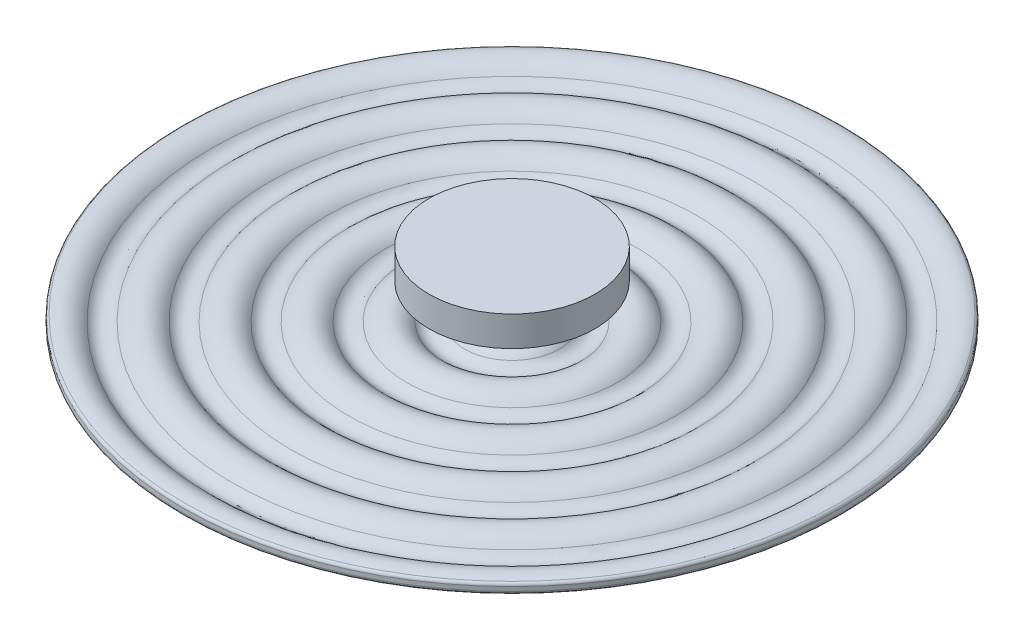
from build123d import *

# Parameters (mm, degrees)
CORTAR_EXTRUIR1_DEPTH        = 10
CORTAR_EXTRUIR1_DEPTH_BACK   = 10
CROQUIS7_R                   = 5
REDONDEO1_R                  = 2.5
SALIENTE_EXTRUIR1_DEPTH      = 29.972
SALIENTE_EXTRUIR1_DEPTH_BACK = 9.5
CROQUIS8_R                   = 5
CROQUIS9_R                   = 64.008
SALIENTE_EXTRUIR2_DEPTH      = 23.114
CROQUIS10_R                  = 99.949
SALIENTE_EXTRUIR3_DEPTH      = 29.972


with BuildPart() as part:
    # Croquis6 → Revoluci_n1 (revolve)
    with BuildSketch(Plane.XY, mode=Mode.PRIVATE) as revoluci_n1_sk:
        with BuildLine():
            Line((0, -1), (0, -9))
            ThreePointArc((0, -9), (7.756717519, -7.344547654), (14.161763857, -2.666666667))
            ThreePointArc((14.161763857, -2.666666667), (22.360339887, 0.999847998), (30.558915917, -2.666666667))
            ThreePointArc((30.558915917, -2.666666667), (44.720339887, -8.999847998), (58.881763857, -2.666666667))
            ThreePointArc((58.881763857, -2.666666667), (67.080339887, 0.999847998), (75.278915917, -2.666666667))
            ThreePointArc((75.278915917, -2.666666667), (89.440339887, -8.999847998), (103.601763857, -2.666666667))
            ThreePointArc((103.601763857, -2.666666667), (111.800339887, 0.999847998), (119.998915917, -2.666666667))
            ThreePointArc((119.998915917, -2.666666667), (134.160339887, -8.999847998), (148.321763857, -2.666666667))
            ThreePointArc((148.321763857, -2.666666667), (156.520339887, 0.999847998), (164.718915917, -2.666666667))
            ThreePointArc((164.718915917, -2.666666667), (178.880339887, -8.999847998), (193.041763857, -2.666666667))
            ThreePointArc((193.041763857, -2.666666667), (201.240339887, 0.999847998), (209.438915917, -2.666666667))
            ThreePointArc((209.438915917, -2.666666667), (223.600339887, -8.999847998), (237.761763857, -2.666666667))
            ThreePointArc((237.761763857, -2.666666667), (245.960339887, 0.999847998), (254.158915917, -2.666666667))
            Line((254.158915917, -2.666666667), (254.158915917, 7.139907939))
            ThreePointArc((254.158915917, 7.139907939), (242.233228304, 8.630690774), (231.798915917, 2.666666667))
            ThreePointArc((231.798915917, 2.666666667), (223.600339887, -0.999847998), (215.401763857, 2.666666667))
            ThreePointArc((215.401763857, 2.666666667), (201.240339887, 8.999847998), (187.078915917, 2.666666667))
            ThreePointArc((187.078915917, 2.666666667), (178.880339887, -0.999847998), (170.681763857, 2.666666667))
            ThreePointArc((170.681763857, 2.666666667), (156.520339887, 8.999847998), (142.358915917, 2.666666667))
            ThreePointArc((142.358915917, 2.666666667), (134.160339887, -0.999847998), (125.961763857, 2.666666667))
            ThreePointArc((125.961763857, 2.666666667), (111.800339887, 8.999847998), (97.638915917, 2.666666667))
            ThreePointArc((97.638915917, 2.666666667), (89.440339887, -0.999847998), (81.241763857, 2.666666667))
            ThreePointArc((81.241763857, 2.666666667), (67.080339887, 8.999847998), (52.918915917, 2.666666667))
            ThreePointArc((52.918915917, 2.666666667), (44.720339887, -0.999847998), (36.521763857, 2.666666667))
            ThreePointArc((36.521763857, 2.666666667), (22.360339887, 8.999847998), (8.198915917, 2.666666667))
            ThreePointArc((8.198915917, 2.666666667), (4.490731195, -0.041580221), (0, -1))
        make_face()
    revolve(revoluci_n1_sk.sketch.rotate(Axis((0, 10, 0), (0, -1, 0)), 180), axis=Axis((0, 10, 0), (0, -1, 0)))

    # Croquis7 → Cortar-Extruir1 (cut, two sides: drawn at the far end of the back side and taken through both)
    with BuildSketch(Plane(origin=(0, 0, 0), x_dir=(1, 0, 0), z_dir=(0, 1, 0)).offset(-CORTAR_EXTRUIR1_DEPTH_BACK)):
        with Locations(Location((0, 0, 0), (0, 0, 180))):
            Circle(CROQUIS7_R)
    extrude(amount=CORTAR_EXTRUIR1_DEPTH + CORTAR_EXTRUIR1_DEPTH_BACK, mode=Mode.SUBTRACT)

    # Redondeo1
    redondeo1_edges = [part.edges().sort_by_distance(p)[0] for p in [
        (254.158915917, 7.139907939, 0),
        (254.158915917, -2.666666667, 0),
    ]]
    fillet(redondeo1_edges, radius=REDONDEO1_R)

    # Croquis8 → Saliente-Extruir1 (add, two sides: drawn at the far end of the back side and taken through both)
    with BuildSketch(Plane(origin=(0, 0, 0), x_dir=(1, 0, 0), z_dir=(0, 1, 0)).offset(-SALIENTE_EXTRUIR1_DEPTH_BACK)):
        with Locations(Location((0, 0, 0), (0, 0, 270))):
            Circle(CROQUIS8_R)
    extrude(amount=SALIENTE_EXTRUIR1_DEPTH + SALIENTE_EXTRUIR1_DEPTH_BACK)

    # Croquis9 → Saliente-Extruir2 (add)
    with BuildSketch(Plane(origin=(0, 29.972, 0), x_dir=(1, 0, 0), z_dir=(0, 1, 0))):
        with Locations(Location((0, 0, 0), (0, 0, 270))):
            Circle(CROQUIS9_R)
    extrude(amount=SALIENTE_EXTRUIR2_DEPTH)

    # Croquis10 → Saliente-Extruir3 (add)
    with BuildSketch(Plane.XZ.offset(9.5)):
        with Locations(Location((0, 0, 0), (0, 0, 270))):
            Circle(CROQUIS10_R)
    extrude(amount=SALIENTE_EXTRUIR3_DEPTH)


solid = part.part
